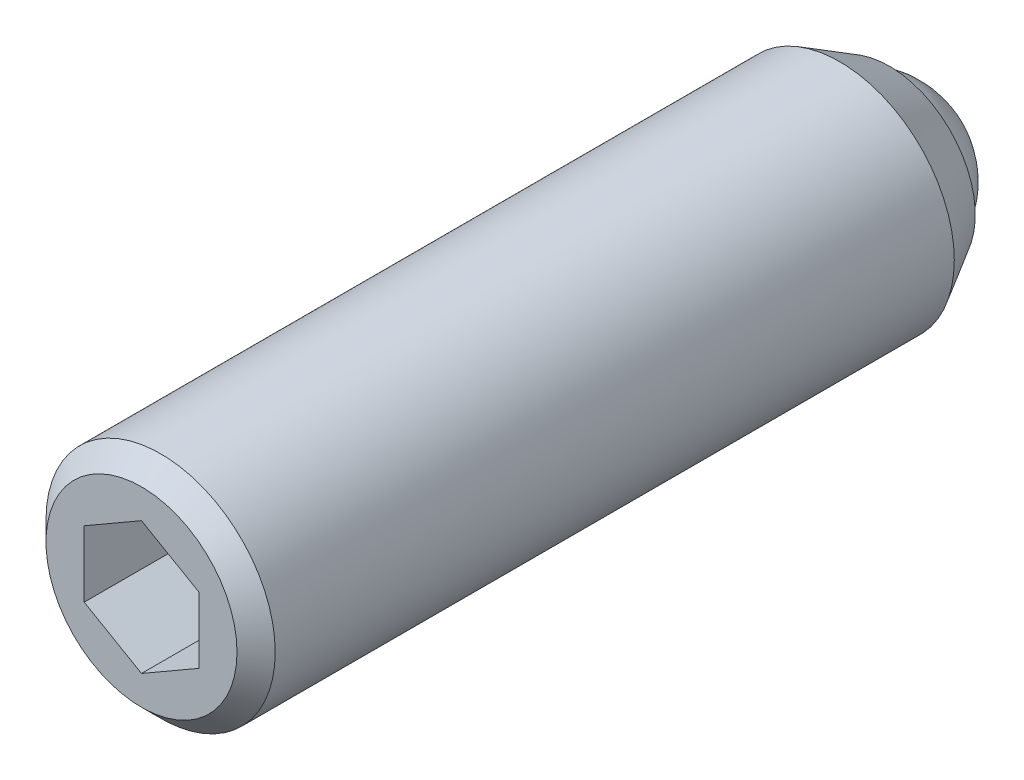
ISO-10303-21;
HEADER;
FILE_DESCRIPTION(('STEP AP214'),'2;1');
FILE_NAME('part.step','',(''),(''),'','','');
FILE_SCHEMA(('AUTOMOTIVE_DESIGN { 1 0 10303 214 1 1 1 1 }'));
ENDSEC;
DATA;
#1=APPLICATION_CONTEXT('core data for automotive mechanical design processes');
#2=APPLICATION_PROTOCOL_DEFINITION('international standard','automotive_design',2000,#1);
#3=PRODUCT_CONTEXT('',#1,'mechanical');
#4=PRODUCT('Part','Part','',(#3));
#5=PRODUCT_RELATED_PRODUCT_CATEGORY('part','',(#4));
#6=PRODUCT_DEFINITION_FORMATION('','',#4);
#7=PRODUCT_DEFINITION_CONTEXT('part definition',#1,'design');
#8=PRODUCT_DEFINITION('design','',#6,#7);
#9=PRODUCT_DEFINITION_SHAPE('','',#8);
#10=(LENGTH_UNIT() NAMED_UNIT(*) SI_UNIT(.MILLI.,.METRE.));
#11=(NAMED_UNIT(*) PLANE_ANGLE_UNIT() SI_UNIT($,.RADIAN.));
#12=(NAMED_UNIT(*) SI_UNIT($,.STERADIAN.) SOLID_ANGLE_UNIT());
#13=UNCERTAINTY_MEASURE_WITH_UNIT(LENGTH_MEASURE(1.E-05),#10,'distance_accuracy_value','');
#14=(GEOMETRIC_REPRESENTATION_CONTEXT(3) GLOBAL_UNCERTAINTY_ASSIGNED_CONTEXT((#13)) GLOBAL_UNIT_ASSIGNED_CONTEXT((#10,
#11,#12)) REPRESENTATION_CONTEXT('',''));
#15=CARTESIAN_POINT('',(0.,0.,0.));
#16=DIRECTION('',(0.,0.,1.));
#17=DIRECTION('',(1.,0.,0.));
#18=AXIS2_PLACEMENT_3D('',#15,#16,#17);
#19=CARTESIAN_POINT('',(3.,1.73205080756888,39.5));
#20=DIRECTION('',(0.5,0.86602540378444,0.));
#21=DIRECTION('',(0.86602540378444,-0.5,0.));
#22=AXIS2_PLACEMENT_3D('',#19,#20,#21);
#23=PLANE('',#22);
#24=DIRECTION('',(0.,0.,1.));
#25=VECTOR('',#24,1.);
#26=CARTESIAN_POINT('',(3.,1.73205080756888,39.5));
#27=LINE('',#26,#25);
#28=CARTESIAN_POINT('',(3.,1.73205080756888,37.));
#29=VERTEX_POINT('',#28);
#30=CARTESIAN_POINT('',(3.,1.73205080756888,42.));
#31=VERTEX_POINT('',#30);
#32=EDGE_CURVE('E68',#29,#31,#27,.T.);
#33=ORIENTED_EDGE('',*,*,#32,.T.);
#34=DIRECTION('',(-0.86602540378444,0.5,0.));
#35=VECTOR('',#34,1.);
#36=CARTESIAN_POINT('',(3.,1.73205080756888,42.));
#37=LINE('',#36,#35);
#38=CARTESIAN_POINT('',(0.,3.46410161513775,42.));
#39=VERTEX_POINT('',#38);
#40=EDGE_CURVE('E29',#31,#39,#37,.T.);
#41=ORIENTED_EDGE('',*,*,#40,.T.);
#42=DIRECTION('',(0.,0.,1.));
#43=VECTOR('',#42,1.);
#44=CARTESIAN_POINT('',(0.,3.46410161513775,39.5));
#45=LINE('',#44,#43);
#46=CARTESIAN_POINT('',(0.,3.46410161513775,37.));
#47=VERTEX_POINT('',#46);
#48=EDGE_CURVE('E80',#47,#39,#45,.T.);
#49=ORIENTED_EDGE('',*,*,#48,.F.);
#50=DIRECTION('',(-0.86602540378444,0.5,0.));
#51=VECTOR('',#50,1.);
#52=CARTESIAN_POINT('',(3.,1.73205080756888,37.));
#53=LINE('',#52,#51);
#54=EDGE_CURVE('E79',#29,#47,#53,.T.);
#55=ORIENTED_EDGE('',*,*,#54,.F.);
#56=EDGE_LOOP('',(#33,#41,#49,#55));
#57=FACE_BOUND('',#56,.T.);
#58=ADVANCED_FACE('F14',(#57),#23,.F.);
#59=CARTESIAN_POINT('',(3.,-1.73205080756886,39.5));
#60=DIRECTION('',(1.,0.,0.));
#61=DIRECTION('',(0.,-1.,0.));
#62=AXIS2_PLACEMENT_3D('',#59,#60,#61);
#63=PLANE('',#62);
#64=DIRECTION('',(0.,0.,1.));
#65=VECTOR('',#64,1.);
#66=CARTESIAN_POINT('',(3.,-1.73205080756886,39.5));
#67=LINE('',#66,#65);
#68=CARTESIAN_POINT('',(3.,-1.73205080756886,37.));
#69=VERTEX_POINT('',#68);
#70=CARTESIAN_POINT('',(3.,-1.73205080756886,42.));
#71=VERTEX_POINT('',#70);
#72=EDGE_CURVE('E76',#69,#71,#67,.T.);
#73=ORIENTED_EDGE('',*,*,#72,.T.);
#74=DIRECTION('',(0.,1.,0.));
#75=VECTOR('',#74,1.);
#76=CARTESIAN_POINT('',(3.,-1.73205080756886,42.));
#77=LINE('',#76,#75);
#78=EDGE_CURVE('E75',#71,#31,#77,.T.);
#79=ORIENTED_EDGE('',*,*,#78,.T.);
#80=ORIENTED_EDGE('',*,*,#32,.F.);
#81=DIRECTION('',(0.,1.,0.));
#82=VECTOR('',#81,1.);
#83=CARTESIAN_POINT('',(3.,-1.73205080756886,37.));
#84=LINE('',#83,#82);
#85=EDGE_CURVE('E72',#69,#29,#84,.T.);
#86=ORIENTED_EDGE('',*,*,#85,.F.);
#87=EDGE_LOOP('',(#73,#79,#80,#86));
#88=FACE_BOUND('',#87,.T.);
#89=ADVANCED_FACE('F70',(#88),#63,.F.);
#90=CARTESIAN_POINT('',(3.,-1.73205080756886,39.5));
#91=DIRECTION('',(-0.5,0.866025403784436,0.));
#92=DIRECTION('',(0.866025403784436,0.5,0.));
#93=AXIS2_PLACEMENT_3D('',#90,#91,#92);
#94=PLANE('',#93);
#95=DIRECTION('',(0.,0.,1.));
#96=VECTOR('',#95,1.);
#97=CARTESIAN_POINT('',(0.,-3.46410161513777,39.5));
#98=LINE('',#97,#96);
#99=CARTESIAN_POINT('',(0.,-3.46410161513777,37.));
#100=VERTEX_POINT('',#99);
#101=CARTESIAN_POINT('',(0.,-3.46410161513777,42.));
#102=VERTEX_POINT('',#101);
#103=EDGE_CURVE('E122',#100,#102,#98,.T.);
#104=ORIENTED_EDGE('',*,*,#103,.T.);
#105=DIRECTION('',(-0.866025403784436,-0.5,0.));
#106=VECTOR('',#105,1.);
#107=CARTESIAN_POINT('',(3.,-1.73205080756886,42.));
#108=LINE('',#107,#106);
#109=EDGE_CURVE('E113',#71,#102,#108,.T.);
#110=ORIENTED_EDGE('',*,*,#109,.F.);
#111=ORIENTED_EDGE('',*,*,#72,.F.);
#112=DIRECTION('',(0.866025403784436,0.5,0.));
#113=VECTOR('',#112,1.);
#114=CARTESIAN_POINT('',(0.,-3.46410161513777,37.));
#115=LINE('',#114,#113);
#116=EDGE_CURVE('E89',#100,#69,#115,.T.);
#117=ORIENTED_EDGE('',*,*,#116,.F.);
#118=EDGE_LOOP('',(#104,#110,#111,#117));
#119=FACE_BOUND('',#118,.T.);
#120=ADVANCED_FACE('F147',(#119),#94,.T.);
#121=CARTESIAN_POINT('',(-3.,-1.73205080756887,39.5));
#122=DIRECTION('',(-0.5,-0.866025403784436,0.));
#123=DIRECTION('',(-0.866025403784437,0.5,0.));
#124=AXIS2_PLACEMENT_3D('',#121,#122,#123);
#125=PLANE('',#124);
#126=DIRECTION('',(0.,0.,1.));
#127=VECTOR('',#126,1.);
#128=CARTESIAN_POINT('',(-3.,-1.73205080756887,39.5));
#129=LINE('',#128,#127);
#130=CARTESIAN_POINT('',(-3.,-1.73205080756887,37.));
#131=VERTEX_POINT('',#130);
#132=CARTESIAN_POINT('',(-3.,-1.73205080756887,42.));
#133=VERTEX_POINT('',#132);
#134=EDGE_CURVE('E120',#131,#133,#129,.T.);
#135=ORIENTED_EDGE('',*,*,#134,.T.);
#136=DIRECTION('',(0.866025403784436,-0.5,0.));
#137=VECTOR('',#136,1.);
#138=CARTESIAN_POINT('',(-3.,-1.73205080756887,42.));
#139=LINE('',#138,#137);
#140=EDGE_CURVE('E111',#133,#102,#139,.T.);
#141=ORIENTED_EDGE('',*,*,#140,.T.);
#142=ORIENTED_EDGE('',*,*,#103,.F.);
#143=DIRECTION('',(0.866025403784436,-0.5,0.));
#144=VECTOR('',#143,1.);
#145=CARTESIAN_POINT('',(-3.,-1.73205080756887,37.));
#146=LINE('',#145,#144);
#147=EDGE_CURVE('E101',#131,#100,#146,.T.);
#148=ORIENTED_EDGE('',*,*,#147,.F.);
#149=EDGE_LOOP('',(#135,#141,#142,#148));
#150=FACE_BOUND('',#149,.T.);
#151=ADVANCED_FACE('F157',(#150),#125,.F.);
#152=CARTESIAN_POINT('',(-3.,-1.73205080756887,39.5));
#153=DIRECTION('',(1.,0.,0.));
#154=DIRECTION('',(0.,-1.,0.));
#155=AXIS2_PLACEMENT_3D('',#152,#153,#154);
#156=PLANE('',#155);
#157=DIRECTION('',(0.,0.,1.));
#158=VECTOR('',#157,1.);
#159=CARTESIAN_POINT('',(-3.,1.73205080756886,39.5));
#160=LINE('',#159,#158);
#161=CARTESIAN_POINT('',(-3.,1.73205080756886,37.));
#162=VERTEX_POINT('',#161);
#163=CARTESIAN_POINT('',(-3.,1.73205080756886,42.));
#164=VERTEX_POINT('',#163);
#165=EDGE_CURVE('E37',#162,#164,#160,.T.);
#166=ORIENTED_EDGE('',*,*,#165,.T.);
#167=DIRECTION('',(0.,1.,0.));
#168=VECTOR('',#167,1.);
#169=CARTESIAN_POINT('',(-3.,-1.73205080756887,42.));
#170=LINE('',#169,#168);
#171=EDGE_CURVE('E108',#133,#164,#170,.T.);
#172=ORIENTED_EDGE('',*,*,#171,.F.);
#173=ORIENTED_EDGE('',*,*,#134,.F.);
#174=DIRECTION('',(0.,-1.,0.));
#175=VECTOR('',#174,1.);
#176=CARTESIAN_POINT('',(-3.,1.73205080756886,37.));
#177=LINE('',#176,#175);
#178=EDGE_CURVE('E98',#162,#131,#177,.T.);
#179=ORIENTED_EDGE('',*,*,#178,.F.);
#180=EDGE_LOOP('',(#166,#172,#173,#179));
#181=FACE_BOUND('',#180,.T.);
#182=ADVANCED_FACE('F153',(#181),#156,.T.);
#183=CARTESIAN_POINT('',(-3.,1.73205080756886,39.5));
#184=DIRECTION('',(0.5,-0.866025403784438,0.));
#185=DIRECTION('',(-0.866025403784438,-0.5,0.));
#186=AXIS2_PLACEMENT_3D('',#183,#184,#185);
#187=PLANE('',#186);
#188=ORIENTED_EDGE('',*,*,#165,.F.);
#189=DIRECTION('',(-0.866025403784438,-0.5,0.));
#190=VECTOR('',#189,1.);
#191=CARTESIAN_POINT('',(0.,3.46410161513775,37.));
#192=LINE('',#191,#190);
#193=EDGE_CURVE('E84',#47,#162,#192,.T.);
#194=ORIENTED_EDGE('',*,*,#193,.F.);
#195=ORIENTED_EDGE('',*,*,#48,.T.);
#196=DIRECTION('',(0.866025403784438,0.5,0.));
#197=VECTOR('',#196,1.);
#198=CARTESIAN_POINT('',(-3.,1.73205080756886,42.));
#199=LINE('',#198,#197);
#200=EDGE_CURVE('E105',#164,#39,#199,.T.);
#201=ORIENTED_EDGE('',*,*,#200,.F.);
#202=EDGE_LOOP('',(#188,#194,#195,#201));
#203=FACE_BOUND('',#202,.T.);
#204=ADVANCED_FACE('F150',(#203),#187,.T.);
#205=CARTESIAN_POINT('',(0.,0.,41.75));
#206=DIRECTION('',(0.,0.,-1.));
#207=DIRECTION('',(1.,0.,0.));
#208=AXIS2_PLACEMENT_3D('',#205,#206,#207);
#209=CYLINDRICAL_SURFACE('',#208,6.);
#210=CARTESIAN_POINT('',(0.,0.,41.));
#211=DIRECTION('',(0.,0.,-1.));
#212=DIRECTION('',(1.,0.,0.));
#213=AXIS2_PLACEMENT_3D('',#210,#211,#212);
#214=CIRCLE('',#213,6.);
#215=CARTESIAN_POINT('',(6.,0.,41.));
#216=VERTEX_POINT('',#215);
#217=EDGE_CURVE('E9',#216,#216,#214,.T.);
#218=ORIENTED_EDGE('',*,*,#217,.T.);
#219=EDGE_LOOP('',(#218));
#220=FACE_BOUND('',#219,.T.);
#221=CARTESIAN_POINT('',(0.,0.,5.44807621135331));
#222=DIRECTION('',(0.,0.,-1.));
#223=DIRECTION('',(-1.,0.,0.));
#224=AXIS2_PLACEMENT_3D('',#221,#222,#223);
#225=CIRCLE('',#224,6.);
#226=CARTESIAN_POINT('',(-6.,0.,5.44807621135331));
#227=VERTEX_POINT('',#226);
#228=EDGE_CURVE('E244',#227,#227,#225,.T.);
#229=ORIENTED_EDGE('',*,*,#228,.F.);
#230=EDGE_LOOP('',(#229));
#231=FACE_BOUND('',#230,.T.);
#232=ADVANCED_FACE('F16',(#220,#231),#209,.T.);
#233=CARTESIAN_POINT('',(0.,0.,41.));
#234=DIRECTION('',(0.,0.,-1.));
#235=DIRECTION('',(1.,0.,0.));
#236=AXIS2_PLACEMENT_3D('',#233,#234,#235);
#237=CONICAL_SURFACE('',#236,6.,0.785398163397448);
#238=CARTESIAN_POINT('',(0.,0.,42.));
#239=DIRECTION('',(0.,0.,-1.));
#240=DIRECTION('',(1.,0.,0.));
#241=AXIS2_PLACEMENT_3D('',#238,#239,#240);
#242=CIRCLE('',#241,5.);
#243=CARTESIAN_POINT('',(5.,0.,42.));
#244=VERTEX_POINT('',#243);
#245=EDGE_CURVE('E22',#244,#244,#242,.T.);
#246=ORIENTED_EDGE('',*,*,#245,.T.);
#247=EDGE_LOOP('',(#246));
#248=FACE_BOUND('',#247,.T.);
#249=ORIENTED_EDGE('',*,*,#217,.F.);
#250=EDGE_LOOP('',(#249));
#251=FACE_BOUND('',#250,.T.);
#252=ADVANCED_FACE('F127',(#248,#251),#237,.T.);
#253=CARTESIAN_POINT('',(0.,0.,42.));
#254=DIRECTION('',(0.,0.,-1.));
#255=DIRECTION('',(1.,0.,0.));
#256=AXIS2_PLACEMENT_3D('',#253,#254,#255);
#257=PLANE('',#256);
#258=ORIENTED_EDGE('',*,*,#200,.T.);
#259=ORIENTED_EDGE('',*,*,#40,.F.);
#260=ORIENTED_EDGE('',*,*,#78,.F.);
#261=ORIENTED_EDGE('',*,*,#109,.T.);
#262=ORIENTED_EDGE('',*,*,#140,.F.);
#263=ORIENTED_EDGE('',*,*,#171,.T.);
#264=EDGE_LOOP('',(#258,#259,#260,#261,#262,#263));
#265=FACE_BOUND('',#264,.T.);
#266=ORIENTED_EDGE('',*,*,#245,.F.);
#267=EDGE_LOOP('',(#266));
#268=FACE_BOUND('',#267,.T.);
#269=ADVANCED_FACE('F130',(#265,#268),#257,.F.);
#270=CARTESIAN_POINT('',(3.,1.73205080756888,37.));
#271=DIRECTION('',(0.,0.,1.));
#272=DIRECTION('',(1.,0.,0.));
#273=AXIS2_PLACEMENT_3D('',#270,#271,#272);
#274=PLANE('',#273);
#275=ORIENTED_EDGE('',*,*,#85,.T.);
#276=ORIENTED_EDGE('',*,*,#54,.T.);
#277=ORIENTED_EDGE('',*,*,#193,.T.);
#278=ORIENTED_EDGE('',*,*,#178,.T.);
#279=ORIENTED_EDGE('',*,*,#147,.T.);
#280=ORIENTED_EDGE('',*,*,#116,.T.);
#281=EDGE_LOOP('',(#275,#276,#277,#278,#279,#280));
#282=FACE_BOUND('',#281,.T.);
#283=ADVANCED_FACE('F86',(#282),#274,.T.);
#284=CARTESIAN_POINT('',(0.,0.,4.35));
#285=DIRECTION('',(0.,0.,-1.));
#286=DIRECTION('',(-1.,0.,0.));
#287=AXIS2_PLACEMENT_3D('',#284,#285,#286);
#288=SPHERICAL_SURFACE('',#287,4.35);
#289=CARTESIAN_POINT('',(0.,0.,2.85));
#290=DIRECTION('',(0.,0.,-1.));
#291=DIRECTION('',(-1.,0.,0.));
#292=AXIS2_PLACEMENT_3D('',#289,#290,#291);
#293=CIRCLE('',#292,4.08319727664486);
#294=CARTESIAN_POINT('',(-4.08319727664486,0.,2.85));
#295=VERTEX_POINT('',#294);
#296=EDGE_CURVE('E90',#295,#295,#293,.T.);
#297=ORIENTED_EDGE('',*,*,#296,.T.);
#298=EDGE_LOOP('',(#297));
#299=FACE_BOUND('',#298,.T.);
#300=ADVANCED_FACE('F139',(#299),#288,.T.);
#301=CARTESIAN_POINT('',(-4.08319727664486,0.,2.85));
#302=DIRECTION('',(0.,0.,-1.));
#303=DIRECTION('',(-1.,0.,0.));
#304=AXIS2_PLACEMENT_3D('',#301,#302,#303);
#305=PLANE('',#304);
#306=CARTESIAN_POINT('',(0.,0.,2.85));
#307=DIRECTION('',(0.,0.,-1.));
#308=DIRECTION('',(-1.,0.,0.));
#309=AXIS2_PLACEMENT_3D('',#306,#307,#308);
#310=CIRCLE('',#309,4.5);
#311=CARTESIAN_POINT('',(-4.5,0.,2.85));
#312=VERTEX_POINT('',#311);
#313=EDGE_CURVE('E93',#312,#312,#310,.T.);
#314=ORIENTED_EDGE('',*,*,#313,.T.);
#315=EDGE_LOOP('',(#314));
#316=FACE_BOUND('',#315,.T.);
#317=ORIENTED_EDGE('',*,*,#296,.F.);
#318=EDGE_LOOP('',(#317));
#319=FACE_BOUND('',#318,.T.);
#320=ADVANCED_FACE('F216',(#316,#319),#305,.T.);
#321=CARTESIAN_POINT('',(0.,0.,2.85));
#322=DIRECTION('',(0.,0.,1.));
#323=DIRECTION('',(1.,0.,0.));
#324=AXIS2_PLACEMENT_3D('',#321,#322,#323);
#325=CONICAL_SURFACE('',#324,4.5,0.523598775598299);
#326=ORIENTED_EDGE('',*,*,#228,.T.);
#327=EDGE_LOOP('',(#326));
#328=FACE_BOUND('',#327,.T.);
#329=ORIENTED_EDGE('',*,*,#313,.F.);
#330=EDGE_LOOP('',(#329));
#331=FACE_BOUND('',#330,.T.);
#332=ADVANCED_FACE('F225',(#328,#331),#325,.T.);
#333=CLOSED_SHELL('',(#58,#89,#120,#151,#182,#204,#232,#252,#269,#283,#300,#320,#332));
#334=MANIFOLD_SOLID_BREP('B1',#333);
#335=ADVANCED_BREP_SHAPE_REPRESENTATION('',(#18,#334),#14);
#336=SHAPE_DEFINITION_REPRESENTATION(#9,#335);
ENDSEC;
END-ISO-10303-21;
